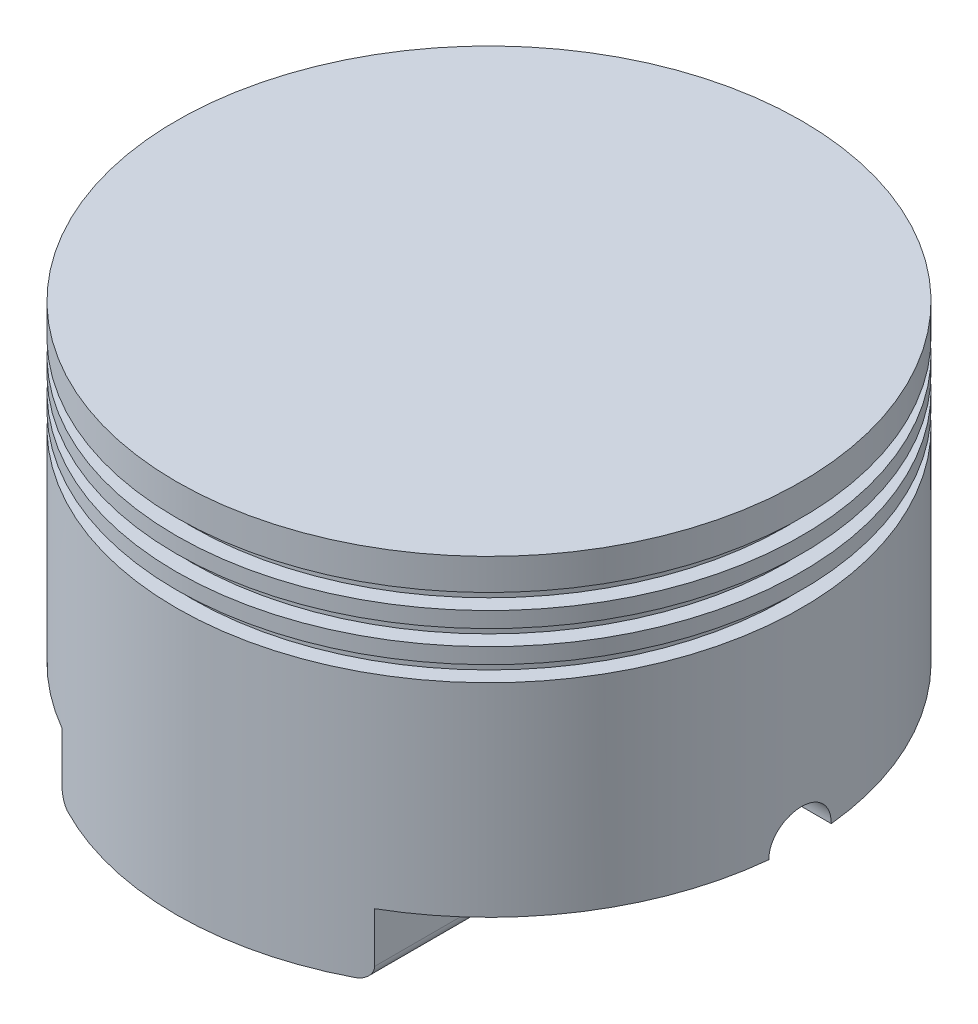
from build123d import *

# Parameters (mm, degrees)
SKETCH2_R               = 57.15
CUT_EXTRUDE1_DEPTH      = 50.8
CUT_EXTRUDE3_DEPTH      = 121.65
CUT_EXTRUDE3_DEPTH_BACK = 121.65
SKETCH5_W               = 63.5
SKETCH5_H               = 25.4
BOSS_EXTRUDE2_START     = 50.8
BOSS_EXTRUDE2_DEPTH     = 50.8
CUT_EXTRUDE5_DEPTH      = 121.65
CUT_EXTRUDE5_DEPTH_BACK = 121.65
SKETCH8_R               = 6.35
FILLET1_R               = 2.54
CUT_EXTRUDE6_START      = -5.08
SKETCH9_R               = 8.509
CUT_EXTRUDE6_DEPTH      = 1.524
SKETCH11_R              = 6.35
CUT_EXTRUDE7_DEPTH      = 6.35
CUT_EXTRUDE7_DRAFT      = 25
MIRROR1_COPY_1_SKETCH_R = 6.35
MIRROR1_COPY_1_DEPTH    = 6.35
MIRROR1_COPY_1_DRAFT    = 25
CUT_EXTRUDE12_START     = -6.35
SKETCH13_R              = 8.509
CUT_EXTRUDE12_DEPTH     = 1.27


with BuildPart() as part:
    # Sketch1 → Revolve1 (revolve)
    with BuildSketch(Plane.XY, mode=Mode.PRIVATE) as revolve1_sk:
        Polygon((-31.75, 31.75), (-31.75, 38.1), (31.75, 38.1), (31.75, -38.1), (-31.75, -38.1), (-31.75, 15.875), (-28.575, 15.875), (-28.575, 19.05), (-31.75, 19.05), (-31.75, 22.225), (-28.575, 22.225), (-28.575, 25.4), (-31.75, 25.4), (-31.75, 28.575), (-28.575, 28.575), (-28.575, 31.75), align=None)
    revolve(revolve1_sk.sketch.rotate(Axis((31.75, -38.1, 0), (0, 1, 0)), 270), axis=Axis((31.75, -38.1, 0), (0, 1, 0)))

    # Sketch2 → Cut-Extrude1 (cut)
    with BuildSketch(Plane.XZ.offset(38.1)):
        with Locations(Location((31.75, 0, 0), (0, 0, 270))):
            Circle(SKETCH2_R)
    extrude(amount=-CUT_EXTRUDE1_DEPTH, mode=Mode.SUBTRACT)

    # Sketch5 → Cut-Extrude3 (cut, two sides: drawn at the far end of the back side and taken through both)
    with BuildSketch(Plane.XY.offset(-CUT_EXTRUDE3_DEPTH_BACK)):
        with Locations((-31.75, -38.1)):
            Rectangle(SKETCH5_W, SKETCH5_H)
        with Locations((95.25, -38.1)):
            Rectangle(SKETCH5_W, SKETCH5_H)
    extrude(amount=CUT_EXTRUDE3_DEPTH + CUT_EXTRUDE3_DEPTH_BACK, mode=Mode.SUBTRACT)

    # Sketch6 → Boss-Extrude2 (add)
    with BuildSketch(Plane.XZ.offset(-12.7).offset(BOSS_EXTRUDE2_START)):
        with BuildLine():
            Line((12.7, -25.4), (12.7, 25.4))
            Line((12.7, 25.4), (6.35, 25.4))
            Line((6.35, 25.4), (6.35, 51.195336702))
            ThreePointArc((6.35, 51.195336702), (3.115939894, 49.459206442), (0, 47.519048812))
            Line((0, 47.519048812), (0, 25.4))
            Line((0, 25.4), (0, -25.4))
            Line((0, -25.4), (0, -47.519048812))
            ThreePointArc((0, -47.519048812), (3.115939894, -49.459206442), (6.35, -51.195336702))
            Line((6.35, -51.195336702), (6.35, -25.4))
            Line((6.35, -25.4), (12.7, -25.4))
        make_face()
        with BuildLine():
            ThreePointArc((63.5, 47.519048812), (60.384060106, 49.459206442), (57.15, 51.195336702))
            Line((57.15, 51.195336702), (57.15, 25.4))
            Line((57.15, 25.4), (50.8, 25.4))
            Line((50.8, 25.4), (50.8, -25.4))
            Line((50.8, -25.4), (57.15, -25.4))
            Line((57.15, -25.4), (57.15, -51.195336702))
            ThreePointArc((57.15, -51.195336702), (60.384060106, -49.459206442), (63.5, -47.519048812))
            Line((63.5, -47.519048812), (63.5, -25.4))
            Line((63.5, -25.4), (63.5, 25.4))
            Line((63.5, 25.4), (63.5, 47.519048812))
        make_face()
    extrude(amount=-BOSS_EXTRUDE2_DEPTH)

    # Sketch8 → Cut-Extrude5 (cut, two sides: drawn at the far end of the back side and taken through both)
    with BuildSketch(Plane(origin=(0, 0, 0), x_dir=(0, 0, -1), z_dir=(1, 0, 0)).offset(-CUT_EXTRUDE5_DEPTH_BACK)):
        with Locations((0, -25.4)):
            Circle(SKETCH8_R)
    extrude(amount=CUT_EXTRUDE5_DEPTH + CUT_EXTRUDE5_DEPTH_BACK, mode=Mode.SUBTRACT)

    # Fillet1
    fillet1_edges = [part.edges().sort_by_distance(p)[0] for p in [
        (50.8, -38.1, 0),
        (53.975, -38.1, -25.4),
        (57.15, -38.1, -38.297668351),
        (53.975, -38.1, 25.4),
        (57.15, -38.1, 38.297668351),
        (0, -38.1, 0),
        (63.5, -38.1, 0),
        (6.35, -38.1, 38.297668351),
        (9.525, -38.1, 25.4),
        (6.35, -38.1, -38.297668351),
        (9.525, -38.1, -25.4),
        (12.7, -38.1, 0),
    ]]
    fillet(fillet1_edges, radius=FILLET1_R)

    # Sketch9 → Cut-Extrude6 (cut)
    with BuildSketch(Plane(origin=(63.5, 0, 0), x_dir=(0, 0, -1), z_dir=(1, 0, 0)).offset(CUT_EXTRUDE6_START)):
        with Locations((0, -25.4)):
            Circle(SKETCH9_R)
    extrude(amount=-CUT_EXTRUDE6_DEPTH, mode=Mode.SUBTRACT)


with BuildPart() as cut_extrude7_tool:
    # Sketch11 → Cut-Extrude7 (with draft: the straight prism first)
    with BuildSketch(Plane.ZY.offset(-58.42)):
        with Locations(Location((0, -25.4, 0), (0, 0, 180))):
            Circle(SKETCH11_R)
    extrude(amount=-CUT_EXTRUDE7_DEPTH)
    # Cut-Extrude7: the draft: its side faces are tilted about the plane it starts from
    cut_extrude7_sides = [cut_extrude7_tool.faces().sort_by_distance(p)[0] for p in [
        (61.595, -25.4, 6.35),
    ]]
    draft(cut_extrude7_sides, Plane.ZY.offset(-58.42), CUT_EXTRUDE7_DRAFT)


with BuildPart() as part_1:
    add(part.part)

    # Cut-Extrude7: cut by cut_extrude7_tool
    add(cut_extrude7_tool.part, mode=Mode.SUBTRACT)


with BuildPart() as mirror1_copy_1_tool:
    # Mirror1 copy 1 sketch → Mirror1 copy 1 (with draft: the straight prism first)
    with BuildSketch(Plane(origin=(5.08, 0, 0), x_dir=(0, 0, 1), z_dir=(1, 0, 0))):
        with Locations((0, 25.4)):
            Circle(MIRROR1_COPY_1_SKETCH_R)
    extrude(amount=-MIRROR1_COPY_1_DEPTH)
    # Mirror1 copy 1: the draft: its side faces are tilted about the plane it starts from
    mirror1_copy_1_sides = [mirror1_copy_1_tool.faces().sort_by_distance(p)[0] for p in [
        (1.905, -25.4, 6.35),
    ]]
    draft(mirror1_copy_1_sides, Plane(origin=(5.08, 0, 0), x_dir=(0, 0, 1), z_dir=(1, 0, 0)), MIRROR1_COPY_1_DRAFT)


with BuildPart() as part_2:
    add(part_1.part)

    # Mirror1 copy 1: cut by mirror1_copy_1_tool
    add(mirror1_copy_1_tool.part, mode=Mode.SUBTRACT)

    # Sketch13 → Cut-Extrude12 (cut)
    with BuildSketch(Plane.ZY.offset(CUT_EXTRUDE12_START)):
        with Locations(Location((0, -25.4, 0), (0, 0, 180))):
            Circle(SKETCH13_R)
    extrude(amount=CUT_EXTRUDE12_DEPTH, mode=Mode.SUBTRACT)


solid = part_2.part
